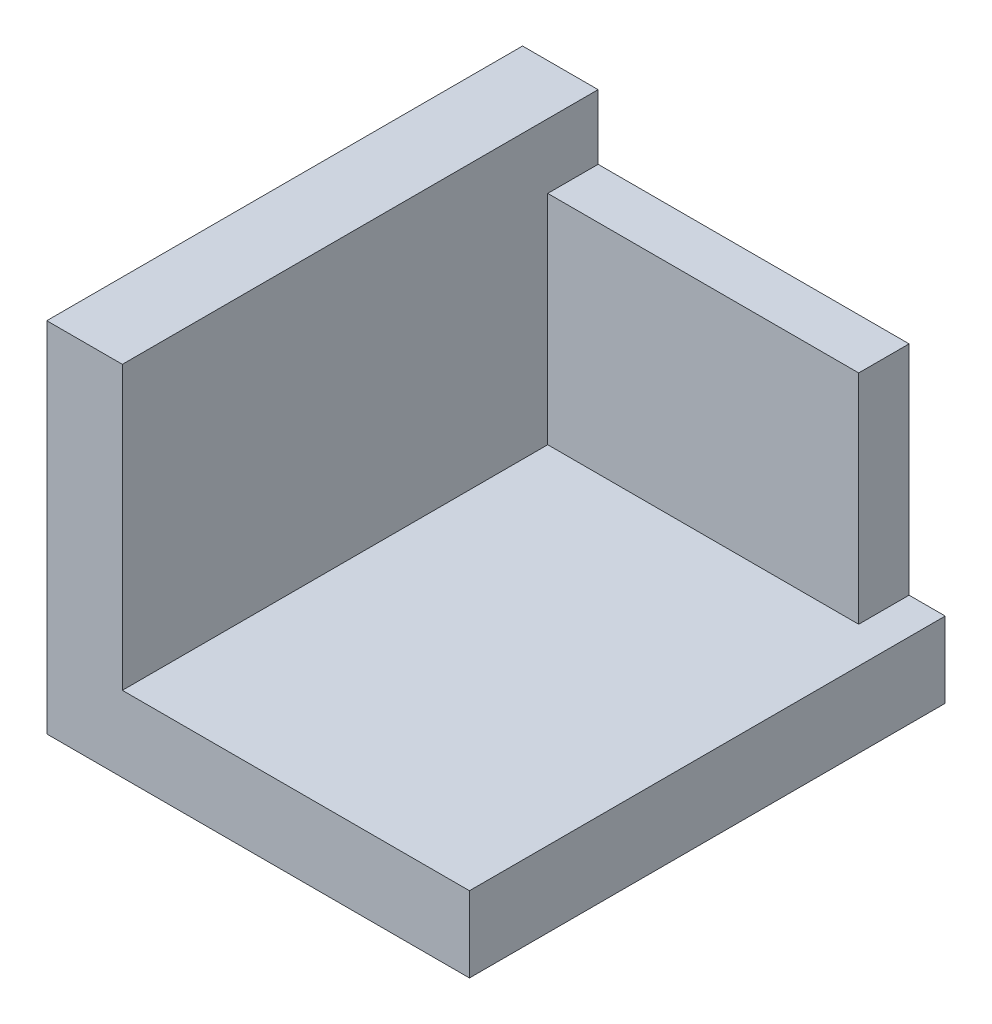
from build123d import *

# Parameters (mm, degrees)
SKETCH3_W           = 68.887617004
SKETCH3_H           = 94.423546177
BOSS_EXTRUDE2_DEPTH = 15
SKETCH4_W           = 94.423546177
SKETCH4_H           = 71.033019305
BOSS_EXTRUDE3_DEPTH = 15
SKETCH5_W           = 61.715301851
SKETCH5_H           = 43.19896845
BOSS_EXTRUDE4_DEPTH = 10


with BuildPart() as part:
    # Sketch3 → Boss-Extrude2 (new body)
    with BuildSketch(Plane(origin=(0, 0, 0), x_dir=(1, 0, 0), z_dir=(0, 1, 0))):
        with Locations((34.443808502, 47.211773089)):
            Rectangle(SKETCH3_W, SKETCH3_H)
    extrude(amount=BOSS_EXTRUDE2_DEPTH)

    # Sketch4 → Boss-Extrude3 (add)
    with BuildSketch(Plane.ZY):
        with Locations((-47.211773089, 35.516509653)):
            Rectangle(SKETCH4_W, SKETCH4_H)
    extrude(amount=BOSS_EXTRUDE3_DEPTH)

    # Sketch5 → Boss-Extrude4 (add)
    with BuildSketch(Plane(origin=(0, 0, -94.423546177), x_dir=(-1, 0, 0), z_dir=(0, 0, -1))):
        with Locations((-30.857650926, 36.599484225)):
            Rectangle(SKETCH5_W, SKETCH5_H)
    extrude(amount=-BOSS_EXTRUDE4_DEPTH)


solid = part.part
